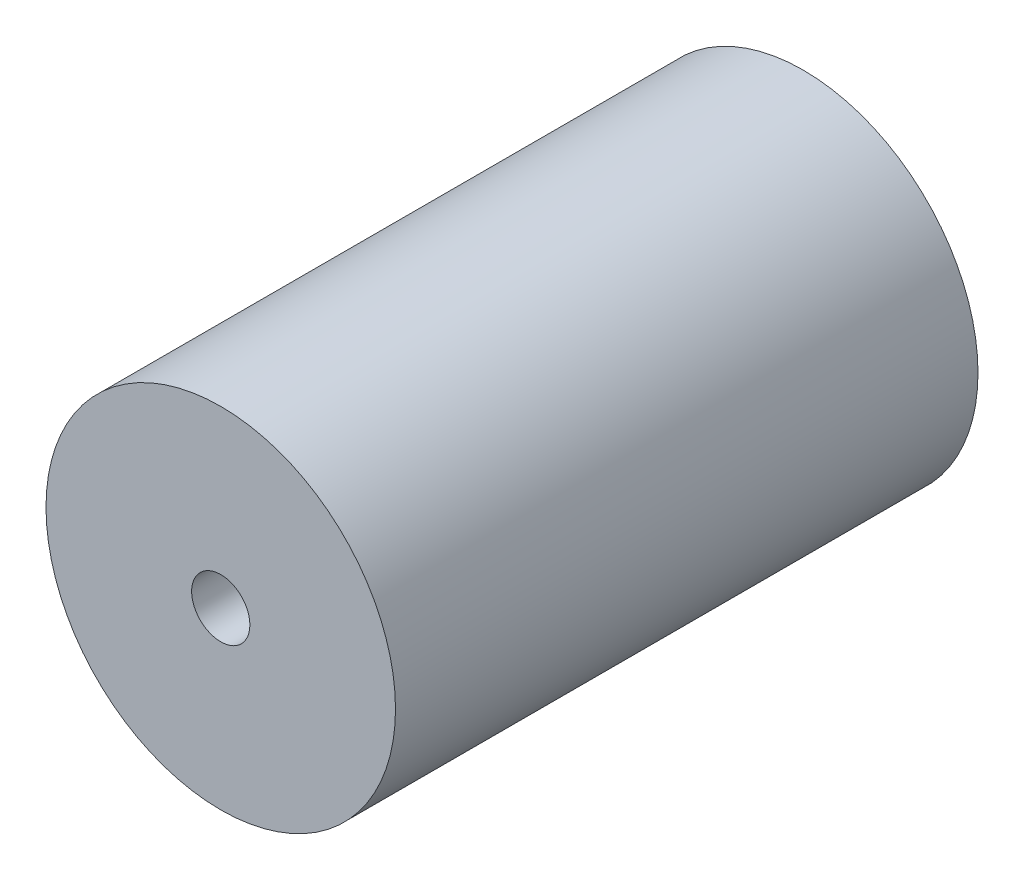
from build123d import *

# Parameters (mm, degrees)
ESQUISSE1_R               = 15
EXTRUSION1_DEPTH          = 50
TROU_TARAUD_M6X1_01_D     = 5
TROU_TARAUD_M6X1_01_DEPTH = 18
TROU_TARAUD_M6X1_01_TIP   = 1.502151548


with BuildPart() as part:
    # Esquisse1 → Extrusion1 (new body)
    with BuildSketch(Plane.XY):
        Circle(ESQUISSE1_R)
    extrude(amount=EXTRUSION1_DEPTH)

    # Trou taraud_ M6x1.01
    with Locations(Plane.XY.offset(50)):
        with Locations((0, 0)):
            Hole(TROU_TARAUD_M6X1_01_D / 2, depth=TROU_TARAUD_M6X1_01_DEPTH)
            with Locations((0, 0, -(TROU_TARAUD_M6X1_01_DEPTH + TROU_TARAUD_M6X1_01_TIP / 2))):  # 118° drill point
                Cone(0, TROU_TARAUD_M6X1_01_D / 2, TROU_TARAUD_M6X1_01_TIP, mode=Mode.SUBTRACT)


solid = part.part
